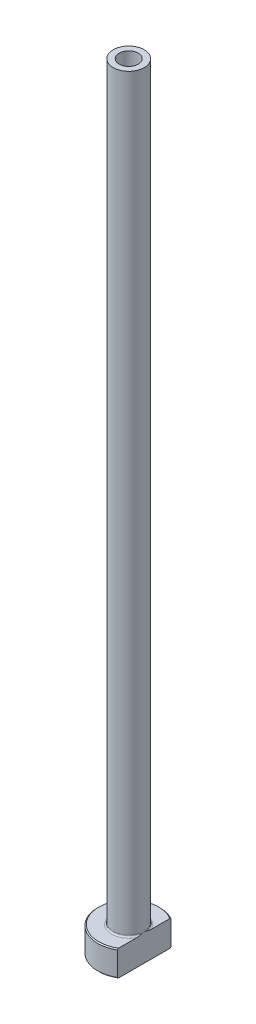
ISO-10303-21;
HEADER;
FILE_DESCRIPTION(('STEP AP214'),'2;1');
FILE_NAME('part.step','',(''),(''),'','','');
FILE_SCHEMA(('AUTOMOTIVE_DESIGN { 1 0 10303 214 1 1 1 1 }'));
ENDSEC;
DATA;
#1=APPLICATION_CONTEXT('core data for automotive mechanical design processes');
#2=APPLICATION_PROTOCOL_DEFINITION('international standard','automotive_design',2000,#1);
#3=PRODUCT_CONTEXT('',#1,'mechanical');
#4=PRODUCT('Part','Part','',(#3));
#5=PRODUCT_RELATED_PRODUCT_CATEGORY('part','',(#4));
#6=PRODUCT_DEFINITION_FORMATION('','',#4);
#7=PRODUCT_DEFINITION_CONTEXT('part definition',#1,'design');
#8=PRODUCT_DEFINITION('design','',#6,#7);
#9=PRODUCT_DEFINITION_SHAPE('','',#8);
#10=(LENGTH_UNIT() NAMED_UNIT(*) SI_UNIT(.MILLI.,.METRE.));
#11=(NAMED_UNIT(*) PLANE_ANGLE_UNIT() SI_UNIT($,.RADIAN.));
#12=(NAMED_UNIT(*) SI_UNIT($,.STERADIAN.) SOLID_ANGLE_UNIT());
#13=UNCERTAINTY_MEASURE_WITH_UNIT(LENGTH_MEASURE(1.E-05),#10,'distance_accuracy_value','');
#14=(GEOMETRIC_REPRESENTATION_CONTEXT(3) GLOBAL_UNCERTAINTY_ASSIGNED_CONTEXT((#13)) GLOBAL_UNIT_ASSIGNED_CONTEXT((#10,
#11,#12)) REPRESENTATION_CONTEXT('',''));
#15=CARTESIAN_POINT('',(0.,0.,0.));
#16=DIRECTION('',(0.,0.,1.));
#17=DIRECTION('',(1.,0.,0.));
#18=AXIS2_PLACEMENT_3D('',#15,#16,#17);
#19=CARTESIAN_POINT('',(0.,92.1876809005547,0.));
#20=DIRECTION('',(0.,1.,0.));
#21=DIRECTION('',(0.,0.,1.));
#22=AXIS2_PLACEMENT_3D('',#19,#20,#21);
#23=CYLINDRICAL_SURFACE('',#22,1.85);
#24=CARTESIAN_POINT('',(0.,150.,0.));
#25=DIRECTION('',(0.,1.,0.));
#26=DIRECTION('',(0.,0.,1.));
#27=AXIS2_PLACEMENT_3D('',#24,#25,#26);
#28=CIRCLE('',#27,1.85);
#29=CARTESIAN_POINT('',(0.,150.,1.85));
#30=VERTEX_POINT('',#29);
#31=EDGE_CURVE('E167',#30,#30,#28,.T.);
#32=ORIENTED_EDGE('',*,*,#31,.T.);
#33=EDGE_LOOP('',(#32));
#34=FACE_BOUND('',#33,.T.);
#35=CARTESIAN_POINT('',(0.,105.,0.));
#36=DIRECTION('',(0.,1.,0.));
#37=DIRECTION('',(0.,0.,1.));
#38=AXIS2_PLACEMENT_3D('',#35,#36,#37);
#39=CIRCLE('',#38,1.85);
#40=CARTESIAN_POINT('',(0.,105.,1.85));
#41=VERTEX_POINT('',#40);
#42=EDGE_CURVE('E170',#41,#41,#39,.T.);
#43=ORIENTED_EDGE('',*,*,#42,.F.);
#44=EDGE_LOOP('',(#43));
#45=FACE_BOUND('',#44,.T.);
#46=ADVANCED_FACE('F32',(#34,#45),#23,.F.);
#47=CARTESIAN_POINT('',(-1.85,150.,0.));
#48=DIRECTION('',(0.,1.,0.));
#49=DIRECTION('',(0.,0.,1.));
#50=AXIS2_PLACEMENT_3D('',#47,#48,#49);
#51=PLANE('',#50);
#52=CARTESIAN_POINT('',(0.,150.,0.));
#53=DIRECTION('',(0.,1.,0.));
#54=DIRECTION('',(0.,0.,1.));
#55=AXIS2_PLACEMENT_3D('',#52,#53,#54);
#56=CIRCLE('',#55,3.00000000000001);
#57=CARTESIAN_POINT('',(0.,150.,3.00000000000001));
#58=VERTEX_POINT('',#57);
#59=EDGE_CURVE('E174',#58,#58,#56,.T.);
#60=ORIENTED_EDGE('',*,*,#59,.T.);
#61=EDGE_LOOP('',(#60));
#62=FACE_BOUND('',#61,.T.);
#63=ORIENTED_EDGE('',*,*,#31,.F.);
#64=EDGE_LOOP('',(#63));
#65=FACE_BOUND('',#64,.T.);
#66=ADVANCED_FACE('F157',(#62,#65),#51,.T.);
#67=CARTESIAN_POINT('',(0.,92.1876809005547,0.));
#68=DIRECTION('',(0.,1.,0.));
#69=DIRECTION('',(0.,0.,1.));
#70=AXIS2_PLACEMENT_3D('',#67,#68,#69);
#71=CYLINDRICAL_SURFACE('',#70,3.);
#72=CARTESIAN_POINT('',(0.,5.3,0.));
#73=DIRECTION('',(0.,1.,0.));
#74=DIRECTION('',(0.,0.,1.));
#75=AXIS2_PLACEMENT_3D('',#72,#73,#74);
#76=CIRCLE('',#75,3.);
#77=CARTESIAN_POINT('',(3.,5.3,0.));
#78=VERTEX_POINT('',#77);
#79=EDGE_CURVE('E180',#78,#78,#76,.T.);
#80=ORIENTED_EDGE('',*,*,#79,.T.);
#81=EDGE_LOOP('',(#80));
#82=FACE_BOUND('',#81,.T.);
#83=ORIENTED_EDGE('',*,*,#59,.F.);
#84=EDGE_LOOP('',(#83));
#85=FACE_BOUND('',#84,.T.);
#86=ADVANCED_FACE('F162',(#82,#85),#71,.T.);
#87=CARTESIAN_POINT('',(-2.99999999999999,5.,0.));
#88=DIRECTION('',(0.,1.,0.));
#89=DIRECTION('',(0.,0.,1.));
#90=AXIS2_PLACEMENT_3D('',#87,#88,#89);
#91=PLANE('',#90);
#92=DIRECTION('',(0.,0.,1.));
#93=VECTOR('',#92,1.);
#94=CARTESIAN_POINT('',(3.,5.,0.));
#95=LINE('',#94,#93);
#96=CARTESIAN_POINT('',(3.,5.,-4.96386945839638));
#97=VERTEX_POINT('',#96);
#98=CARTESIAN_POINT('',(3.,5.,-1.37477270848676));
#99=VERTEX_POINT('',#98);
#100=EDGE_CURVE('E54',#97,#99,#95,.T.);
#101=ORIENTED_EDGE('',*,*,#100,.F.);
#102=CARTESIAN_POINT('',(0.,5.,0.));
#103=DIRECTION('',(0.,1.,0.));
#104=DIRECTION('',(0.,0.,1.));
#105=AXIS2_PLACEMENT_3D('',#102,#103,#104);
#106=CIRCLE('',#105,5.80000000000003);
#107=CARTESIAN_POINT('',(2.99999999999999,5.,4.96386945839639));
#108=VERTEX_POINT('',#107);
#109=EDGE_CURVE('E186',#97,#108,#106,.T.);
#110=ORIENTED_EDGE('',*,*,#109,.T.);
#111=CARTESIAN_POINT('',(3.,5.,1.37477270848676));
#112=VERTEX_POINT('',#111);
#113=EDGE_CURVE('E134',#112,#108,#95,.T.);
#114=ORIENTED_EDGE('',*,*,#113,.F.);
#115=CARTESIAN_POINT('',(0.,5.,0.));
#116=DIRECTION('',(0.,1.,0.));
#117=DIRECTION('',(0.,0.,1.));
#118=AXIS2_PLACEMENT_3D('',#115,#116,#117);
#119=CIRCLE('',#118,3.3);
#120=EDGE_CURVE('E183',#112,#99,#119,.F.);
#121=ORIENTED_EDGE('',*,*,#120,.T.);
#122=EDGE_LOOP('',(#101,#110,#114,#121));
#123=FACE_BOUND('',#122,.T.);
#124=ADVANCED_FACE('F197',(#123),#91,.T.);
#125=CARTESIAN_POINT('',(0.,92.1876809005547,0.));
#126=DIRECTION('',(0.,1.,0.));
#127=DIRECTION('',(0.,0.,1.));
#128=AXIS2_PLACEMENT_3D('',#125,#126,#127);
#129=CYLINDRICAL_SURFACE('',#128,5.99999999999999);
#130=DIRECTION('',(0.,-1.,0.));
#131=VECTOR('',#130,1.);
#132=CARTESIAN_POINT('',(2.99999999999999,150.,5.19615242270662));
#133=LINE('',#132,#131);
#134=CARTESIAN_POINT('',(2.99999999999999,4.80000000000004,5.19615242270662));
#135=VERTEX_POINT('',#134);
#136=CARTESIAN_POINT('',(2.99999999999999,0.200000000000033,5.19615242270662));
#137=VERTEX_POINT('',#136);
#138=EDGE_CURVE('E82',#135,#137,#133,.T.);
#139=ORIENTED_EDGE('',*,*,#138,.F.);
#140=CARTESIAN_POINT('',(0.,4.80000000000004,0.));
#141=DIRECTION('',(0.,1.,0.));
#142=DIRECTION('',(0.,0.,1.));
#143=AXIS2_PLACEMENT_3D('',#140,#141,#142);
#144=CIRCLE('',#143,5.99999999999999);
#145=CARTESIAN_POINT('',(3.,4.80000000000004,-5.19615242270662));
#146=VERTEX_POINT('',#145);
#147=EDGE_CURVE('E95',#135,#146,#144,.F.);
#148=ORIENTED_EDGE('',*,*,#147,.T.);
#149=DIRECTION('',(0.,-1.,0.));
#150=VECTOR('',#149,1.);
#151=CARTESIAN_POINT('',(3.,150.,-5.19615242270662));
#152=LINE('',#151,#150);
#153=CARTESIAN_POINT('',(3.,0.200000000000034,-5.19615242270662));
#154=VERTEX_POINT('',#153);
#155=EDGE_CURVE('E192',#146,#154,#152,.T.);
#156=ORIENTED_EDGE('',*,*,#155,.T.);
#157=CARTESIAN_POINT('',(0.,0.200000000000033,0.));
#158=DIRECTION('',(0.,-1.,0.));
#159=DIRECTION('',(0.,0.,-1.));
#160=AXIS2_PLACEMENT_3D('',#157,#158,#159);
#161=CIRCLE('',#160,5.99999999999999);
#162=EDGE_CURVE('E98',#154,#137,#161,.F.);
#163=ORIENTED_EDGE('',*,*,#162,.T.);
#164=EDGE_LOOP('',(#139,#148,#156,#163));
#165=FACE_BOUND('',#164,.T.);
#166=ADVANCED_FACE('F190',(#165),#129,.T.);
#167=CARTESIAN_POINT('',(-5.99999999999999,0.,0.));
#168=DIRECTION('',(0.,-1.,0.));
#169=DIRECTION('',(0.,0.,-1.));
#170=AXIS2_PLACEMENT_3D('',#167,#168,#169);
#171=PLANE('',#170);
#172=CARTESIAN_POINT('',(0.,0.,0.));
#173=DIRECTION('',(0.,-1.,0.));
#174=DIRECTION('',(0.,0.,-1.));
#175=AXIS2_PLACEMENT_3D('',#172,#173,#174);
#176=CIRCLE('',#175,2.59999999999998);
#177=CARTESIAN_POINT('',(0.,0.,-2.59999999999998));
#178=VERTEX_POINT('',#177);
#179=EDGE_CURVE('E40',#178,#178,#176,.F.);
#180=ORIENTED_EDGE('',*,*,#179,.T.);
#181=EDGE_LOOP('',(#180));
#182=FACE_BOUND('',#181,.T.);
#183=DIRECTION('',(0.,0.,-1.));
#184=VECTOR('',#183,1.);
#185=CARTESIAN_POINT('',(2.99999999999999,0.,5.19615242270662));
#186=LINE('',#185,#184);
#187=CARTESIAN_POINT('',(2.99999999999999,0.,4.9638694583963));
#188=VERTEX_POINT('',#187);
#189=CARTESIAN_POINT('',(3.,0.,-4.9638694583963));
#190=VERTEX_POINT('',#189);
#191=EDGE_CURVE('E47',#188,#190,#186,.T.);
#192=ORIENTED_EDGE('',*,*,#191,.F.);
#193=CARTESIAN_POINT('',(0.,0.,0.));
#194=DIRECTION('',(0.,-1.,0.));
#195=DIRECTION('',(0.,0.,-1.));
#196=AXIS2_PLACEMENT_3D('',#193,#194,#195);
#197=CIRCLE('',#196,5.79999999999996);
#198=EDGE_CURVE('E92',#188,#190,#197,.T.);
#199=ORIENTED_EDGE('',*,*,#198,.T.);
#200=EDGE_LOOP('',(#192,#199));
#201=FACE_BOUND('',#200,.T.);
#202=ADVANCED_FACE('F91',(#182,#201),#171,.T.);
#203=CARTESIAN_POINT('',(0.,92.1876809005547,0.));
#204=DIRECTION('',(0.,1.,0.));
#205=DIRECTION('',(0.,0.,1.));
#206=AXIS2_PLACEMENT_3D('',#203,#204,#205);
#207=CYLINDRICAL_SURFACE('',#206,2.1);
#208=CARTESIAN_POINT('',(0.,0.499999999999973,0.));
#209=DIRECTION('',(0.,-1.,0.));
#210=DIRECTION('',(0.,0.,-1.));
#211=AXIS2_PLACEMENT_3D('',#208,#209,#210);
#212=CIRCLE('',#211,2.1);
#213=CARTESIAN_POINT('',(0.,0.499999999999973,-2.1));
#214=VERTEX_POINT('',#213);
#215=EDGE_CURVE('E11',#214,#214,#212,.T.);
#216=ORIENTED_EDGE('',*,*,#215,.T.);
#217=EDGE_LOOP('',(#216));
#218=FACE_BOUND('',#217,.T.);
#219=CARTESIAN_POINT('',(0.,93.,0.));
#220=DIRECTION('',(0.,1.,0.));
#221=DIRECTION('',(0.,0.,1.));
#222=AXIS2_PLACEMENT_3D('',#219,#220,#221);
#223=CIRCLE('',#222,2.1);
#224=CARTESIAN_POINT('',(0.,93.,2.1));
#225=VERTEX_POINT('',#224);
#226=EDGE_CURVE('E172',#225,#225,#223,.T.);
#227=ORIENTED_EDGE('',*,*,#226,.T.);
#228=EDGE_LOOP('',(#227));
#229=FACE_BOUND('',#228,.T.);
#230=ADVANCED_FACE('F215',(#218,#229),#207,.F.);
#231=CARTESIAN_POINT('',(0.,93.,0.));
#232=DIRECTION('',(0.,-1.,0.));
#233=DIRECTION('',(0.,0.,-1.));
#234=AXIS2_PLACEMENT_3D('',#231,#232,#233);
#235=CONICAL_SURFACE('',#234,2.1,0.0208303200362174);
#236=ORIENTED_EDGE('',*,*,#42,.T.);
#237=EDGE_LOOP('',(#236));
#238=FACE_BOUND('',#237,.T.);
#239=ORIENTED_EDGE('',*,*,#226,.F.);
#240=EDGE_LOOP('',(#239));
#241=FACE_BOUND('',#240,.T.);
#242=ADVANCED_FACE('F111',(#238,#241),#235,.F.);
#243=CARTESIAN_POINT('',(0.,5.3,0.));
#244=DIRECTION('',(0.,1.,0.));
#245=DIRECTION('',(0.,0.,1.));
#246=AXIS2_PLACEMENT_3D('',#243,#244,#245);
#247=TOROIDAL_SURFACE('',#246,3.3,0.3);
#248=ORIENTED_EDGE('',*,*,#120,.F.);
#249=CARTESIAN_POINT('',(3.,5.3,0.));
#250=CARTESIAN_POINT('',(3.,5.30000062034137,-1.12611401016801E-10));
#251=CARTESIAN_POINT('',(3.,5.30000124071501,1.79706807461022E-07));
#252=CARTESIAN_POINT('',(3.,5.30000241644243,7.12597549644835E-07));
#253=CARTESIAN_POINT('',(3.,5.30000296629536,1.07470908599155E-06));
#254=CARTESIAN_POINT('',(3.,5.30000408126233,1.93940823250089E-06));
#255=CARTESIAN_POINT('',(3.,5.30000463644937,2.45488613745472E-06));
#256=CARTESIAN_POINT('',(3.,5.30000565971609,3.54465546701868E-06));
#257=CARTESIAN_POINT('',(3.,5.30000612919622,4.117706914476E-06));
#258=CARTESIAN_POINT('',(3.,5.30000778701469,6.25396475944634E-06));
#259=CARTESIAN_POINT('',(3.,5.30000888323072,7.89070882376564E-06));
#260=CARTESIAN_POINT('',(3.,5.30001076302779,1.11998056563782E-05));
#261=CARTESIAN_POINT('',(3.,5.30001156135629,1.28642115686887E-05));
#262=CARTESIAN_POINT('',(3.,5.30001474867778,1.96537177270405E-05));
#263=CARTESIAN_POINT('',(3.,5.30001702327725,2.48380246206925E-05));
#264=CARTESIAN_POINT('',(3.,5.30002052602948,3.48178491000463E-05));
#265=CARTESIAN_POINT('',(3.,5.30002184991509,3.95800633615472E-05));
#266=CARTESIAN_POINT('',(2.99999999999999,5.30003122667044,7.41814390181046E-05));
#267=CARTESIAN_POINT('',(2.99999999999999,5.30003808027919,0.000104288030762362));
#268=CARTESIAN_POINT('',(3.,5.30006804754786,0.000222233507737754));
#269=CARTESIAN_POINT('',(3.,5.3000968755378,0.000308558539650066));
#270=CARTESIAN_POINT('',(2.99999999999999,5.30020809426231,0.000648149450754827));
#271=CARTESIAN_POINT('',(2.99999999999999,5.30028657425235,0.000902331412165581));
#272=CARTESIAN_POINT('',(3.,5.3005987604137,0.001904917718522));
#273=CARTESIAN_POINT('',(3.,5.30083723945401,0.00265218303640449));
#274=CARTESIAN_POINT('',(2.99999999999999,5.3018219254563,0.00574694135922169));
#275=CARTESIAN_POINT('',(2.99999999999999,5.30256224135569,0.00809584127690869));
#276=CARTESIAN_POINT('',(3.00000000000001,5.31160267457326,0.0367678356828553));
#277=CARTESIAN_POINT('',(3.,5.3199381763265,0.0630827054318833));
#278=CARTESIAN_POINT('',(2.99999999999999,5.33621504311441,0.114704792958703));
#279=CARTESIAN_POINT('',(2.99999999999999,5.34415908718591,0.140011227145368));
#280=CARTESIAN_POINT('',(3.,5.36094382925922,0.193774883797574));
#281=CARTESIAN_POINT('',(3.,5.36977415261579,0.222235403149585));
#282=CARTESIAN_POINT('',(2.99999999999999,5.38736474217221,0.279512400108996));
#283=CARTESIAN_POINT('',(2.99999999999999,5.39612323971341,0.308329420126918));
#284=CARTESIAN_POINT('',(2.99999999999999,5.41726575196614,0.378880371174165));
#285=CARTESIAN_POINT('',(2.99999999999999,5.4295272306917,0.420651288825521));
#286=CARTESIAN_POINT('',(2.99999999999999,5.45309597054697,0.503357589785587));
#287=CARTESIAN_POINT('',(2.99999999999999,5.46441924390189,0.544288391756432));
#288=CARTESIAN_POINT('',(2.99999999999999,5.48778169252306,0.632156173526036));
#289=CARTESIAN_POINT('',(2.99999999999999,5.49969678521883,0.679126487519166));
#290=CARTESIAN_POINT('',(2.99999999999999,5.52221484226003,0.773740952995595));
#291=CARTESIAN_POINT('',(2.99999999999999,5.53280772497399,0.821387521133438));
#292=CARTESIAN_POINT('',(2.99999999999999,5.55291503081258,0.920589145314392));
#293=CARTESIAN_POINT('',(2.99999999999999,5.56229188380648,0.972172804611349));
#294=CARTESIAN_POINT('',(2.99999999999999,5.57838694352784,1.07574836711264));
#295=CARTESIAN_POINT('',(2.99999999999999,5.58510535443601,1.12774023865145));
#296=CARTESIAN_POINT('',(2.99999999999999,5.59681427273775,1.24924411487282));
#297=CARTESIAN_POINT('',(2.99999999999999,5.60051317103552,1.31890364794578));
#298=CARTESIAN_POINT('',(2.99999999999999,5.59966579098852,1.42270835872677));
#299=CARTESIAN_POINT('',(2.99999999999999,5.59835823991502,1.4568809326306));
#300=CARTESIAN_POINT('',(2.99999999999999,5.59322745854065,1.52502533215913));
#301=CARTESIAN_POINT('',(2.99999999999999,5.58940645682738,1.55899730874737));
#302=CARTESIAN_POINT('',(2.99999999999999,5.57976146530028,1.61947815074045));
#303=CARTESIAN_POINT('',(2.99999999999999,5.57451506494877,1.64607760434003));
#304=CARTESIAN_POINT('',(2.99999999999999,5.56161153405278,1.69883648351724));
#305=CARTESIAN_POINT('',(2.99999999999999,5.55394338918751,1.7249933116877));
#306=CARTESIAN_POINT('',(2.99999999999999,5.53555176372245,1.77650913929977));
#307=CARTESIAN_POINT('',(2.99999999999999,5.52480031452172,1.801858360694));
#308=CARTESIAN_POINT('',(2.99999999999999,5.49948027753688,1.85054545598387));
#309=CARTESIAN_POINT('',(2.99999999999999,5.48493141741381,1.87389291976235));
#310=CARTESIAN_POINT('',(2.99999999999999,5.45992470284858,1.90552135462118));
#311=CARTESIAN_POINT('',(2.99999999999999,5.45133318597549,1.91527363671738));
#312=CARTESIAN_POINT('',(2.99999999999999,5.43294163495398,1.93360072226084));
#313=CARTESIAN_POINT('',(2.99999999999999,5.42314083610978,1.94217477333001));
#314=CARTESIAN_POINT('',(2.99999999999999,5.40215892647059,1.95778354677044));
#315=CARTESIAN_POINT('',(2.99999999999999,5.39096156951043,1.96479687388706));
#316=CARTESIAN_POINT('',(2.99999999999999,5.36742144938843,1.97652218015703));
#317=CARTESIAN_POINT('',(2.99999999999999,5.35508207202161,1.98124071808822));
#318=CARTESIAN_POINT('',(2.99999999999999,5.33320117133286,1.9869018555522));
#319=CARTESIAN_POINT('',(2.99999999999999,5.323835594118,1.9885295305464));
#320=CARTESIAN_POINT('',(2.99999999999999,5.30496375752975,1.99016898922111));
#321=CARTESIAN_POINT('',(2.99999999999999,5.29545756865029,1.99018155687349));
#322=CARTESIAN_POINT('',(2.99999999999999,5.27659318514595,1.98858978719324));
#323=CARTESIAN_POINT('',(2.99999999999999,5.26723486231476,1.98698693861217));
#324=CARTESIAN_POINT('',(2.99999999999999,5.24889957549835,1.98229727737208));
#325=CARTESIAN_POINT('',(2.99999999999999,5.23992286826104,1.97920948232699));
#326=CARTESIAN_POINT('',(2.99999999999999,5.21981293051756,1.97059641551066));
#327=CARTESIAN_POINT('',(2.99999999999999,5.20887713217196,1.96461176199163));
#328=CARTESIAN_POINT('',(2.99999999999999,5.18811536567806,1.95095727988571));
#329=CARTESIAN_POINT('',(2.99999999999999,5.17829177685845,1.9432839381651));
#330=CARTESIAN_POINT('',(2.99999999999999,5.15512177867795,1.92254223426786));
#331=CARTESIAN_POINT('',(2.99999999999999,5.14247568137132,1.90869680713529));
#332=CARTESIAN_POINT('',(2.99999999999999,5.11944595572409,1.87927587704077));
#333=CARTESIAN_POINT('',(2.99999999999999,5.10906527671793,1.86369815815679));
#334=CARTESIAN_POINT('',(2.99999999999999,5.08309609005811,1.81927355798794));
#335=CARTESIAN_POINT('',(2.99999999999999,5.06948546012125,1.7892808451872));
#336=CARTESIAN_POINT('',(2.99999999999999,5.04658664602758,1.72751962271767));
#337=CARTESIAN_POINT('',(2.99999999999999,5.0373358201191,1.69573828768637));
#338=CARTESIAN_POINT('',(2.99999999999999,5.02214318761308,1.63079918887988));
#339=CARTESIAN_POINT('',(2.99999999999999,5.01626537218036,1.5976268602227));
#340=CARTESIAN_POINT('',(2.99999999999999,5.00734002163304,1.53086029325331));
#341=CARTESIAN_POINT('',(2.99999999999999,5.00429797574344,1.49726536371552));
#342=CARTESIAN_POINT('',(2.99999999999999,5.00059037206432,1.43100872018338));
#343=CARTESIAN_POINT('',(2.99999999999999,4.99985343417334,1.398350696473));
#344=CARTESIAN_POINT('',(2.99999999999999,5.00019322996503,1.33318312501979));
#345=CARTESIAN_POINT('',(2.99999999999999,5.00126261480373,1.30067351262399));
#346=CARTESIAN_POINT('',(2.99999999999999,5.00569854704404,1.22190465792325));
#347=CARTESIAN_POINT('',(2.99999999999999,5.00984986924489,1.17569031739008));
#348=CARTESIAN_POINT('',(2.99999999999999,5.02060876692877,1.08357061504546));
#349=CARTESIAN_POINT('',(2.99999999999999,5.027215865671,1.03766519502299));
#350=CARTESIAN_POINT('',(2.99999999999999,5.04258096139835,0.94513016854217));
#351=CARTESIAN_POINT('',(2.99999999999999,5.05138514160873,0.898508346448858));
#352=CARTESIAN_POINT('',(2.99999999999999,5.0706686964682,0.80549666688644));
#353=CARTESIAN_POINT('',(2.99999999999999,5.08115218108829,0.759107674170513));
#354=CARTESIAN_POINT('',(2.99999999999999,5.10738921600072,0.650207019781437));
#355=CARTESIAN_POINT('',(2.99999999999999,5.12369110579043,0.587828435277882));
#356=CARTESIAN_POINT('',(2.99999999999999,5.15777680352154,0.464212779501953));
#357=CARTESIAN_POINT('',(2.99999999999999,5.17554263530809,0.402970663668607));
#358=CARTESIAN_POINT('',(3.,5.21006724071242,0.287596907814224));
#359=CARTESIAN_POINT('',(3.,5.22671796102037,0.233432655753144));
#360=CARTESIAN_POINT('',(2.99999999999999,5.25241226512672,0.150940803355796));
#361=CARTESIAN_POINT('',(2.99999999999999,5.26131063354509,0.122567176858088));
#362=CARTESIAN_POINT('',(3.,5.27905176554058,0.0662804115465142));
#363=CARTESIAN_POINT('',(3.00000000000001,5.28789327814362,0.0383669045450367));
#364=CARTESIAN_POINT('',(2.99999999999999,5.29743877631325,0.00809257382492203));
#365=CARTESIAN_POINT('',(2.99999999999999,5.29818012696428,0.00574041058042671));
#366=CARTESIAN_POINT('',(3.,5.29916506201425,0.00264489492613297));
#367=CARTESIAN_POINT('',(3.,5.29940274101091,0.00190013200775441));
#368=CARTESIAN_POINT('',(2.99999999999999,5.29971394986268,0.000900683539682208));
#369=CARTESIAN_POINT('',(2.99999999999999,5.29979223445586,0.000647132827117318));
#370=CARTESIAN_POINT('',(3.,5.29990321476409,0.000308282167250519));
#371=CARTESIAN_POINT('',(3.,5.29993200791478,0.000222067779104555));
#372=CARTESIAN_POINT('',(2.99999999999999,5.29996194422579,0.000104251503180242));
#373=CARTESIAN_POINT('',(2.99999999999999,5.29996879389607,7.41614226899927E-05));
#374=CARTESIAN_POINT('',(3.,5.29997816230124,3.95766696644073E-05));
#375=CARTESIAN_POINT('',(3.,5.29997948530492,3.48154655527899E-05));
#376=CARTESIAN_POINT('',(3.,5.29998298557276,2.48376270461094E-05));
#377=CARTESIAN_POINT('',(3.,5.29998525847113,1.9654244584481E-05));
#378=CARTESIAN_POINT('',(3.,5.29998844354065,1.28656650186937E-05));
#379=CARTESIAN_POINT('',(3.,5.29998924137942,1.12013344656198E-05));
#380=CARTESIAN_POINT('',(3.,5.29999112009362,7.89229985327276E-06));
#381=CARTESIAN_POINT('',(3.,5.29999221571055,6.25553499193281E-06));
#382=CARTESIAN_POINT('',(3.,5.29999387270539,4.11914345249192E-06));
#383=CARTESIAN_POINT('',(3.,5.29999434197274,3.5460307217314E-06));
#384=CARTESIAN_POINT('',(3.,5.2999953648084,2.456100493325E-06));
#385=CARTESIAN_POINT('',(3.,5.299995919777,1.94052212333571E-06));
#386=CARTESIAN_POINT('',(3.,5.29999703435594,1.07558312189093E-06));
#387=CARTESIAN_POINT('',(3.,5.29999758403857,7.13339355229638E-07));
#388=CARTESIAN_POINT('',(3.,5.29999875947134,1.80121902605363E-07));
#389=CARTESIAN_POINT('',(3.,5.29999937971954,1.12600845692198E-10));
#390=CARTESIAN_POINT('',(3.,5.3,0.));
#391=B_SPLINE_CURVE_WITH_KNOTS('',3,(#249,#250,#251,#252,#253,#254,#255,#256,#257,#258,#259,
#260,#261,#262,#263,#264,#265,#266,#267,#268,#269,#270,#271,#272,#273,#274,#275,#276,#277,#278,
#279,#280,#281,#282,#283,#284,#285,#286,#287,#288,#289,#290,#291,#292,#293,#294,#295,#296,#297,
#298,#299,#300,#301,#302,#303,#304,#305,#306,#307,#308,#309,#310,#311,#312,#313,#314,#315,#316,
#317,#318,#319,#320,#321,#322,#323,#324,#325,#326,#327,#328,#329,#330,#331,#332,#333,#334,#335,
#336,#337,#338,#339,#340,#341,#342,#343,#344,#345,#346,#347,#348,#349,#350,#351,#352,#353,#354,
#355,#356,#357,#358,#359,#360,#361,#362,#363,#364,#365,#366,#367,#368,#369,#370,#371,#372,#373,
#374,#375,#376,#377,#378,#379,#380,#381,#382,#383,#384,#385,#386,#387,#388,#389,#390),
.UNSPECIFIED.,.T.,.F.,(4,2,2,2,2,2,2,2,2,2,2,2,2,2,2,2,2,2,2,2,2,2,2,2,2,2,2,2,2,2,2,2,2,2,2,2,
2,2,2,2,2,2,2,2,2,2,2,2,2,2,2,2,2,2,2,2,2,2,2,2,2,2,2,2,2,2,2,2,2,2,4),(0.,1.86513890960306E-06,
3.83353294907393E-06,6.09513300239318E-06,8.31560621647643E-06,1.42000707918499E-05,
1.97335509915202E-05,3.66769873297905E-05,5.14858328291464E-05,0.000144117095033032,
0.000416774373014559,0.00121521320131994,0.00356794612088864,0.0109568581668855,
0.0937636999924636,0.173336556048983,0.262732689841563,0.35308814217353,0.483684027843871,
0.611082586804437,0.756439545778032,0.902844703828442,1.06007042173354,1.21728406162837,
1.42611662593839,1.52864191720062,1.63107642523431,1.71232857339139,1.79395571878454,
1.87634808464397,1.95832065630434,1.99722769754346,2.03615946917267,2.07559591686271,
2.11491897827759,2.14330913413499,2.17168550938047,2.20003575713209,2.22840478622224,
2.26559554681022,2.30286442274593,2.35880214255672,2.41481225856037,2.51307007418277,
2.61215518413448,2.71306273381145,2.81416520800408,2.91210427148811,3.00964583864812,
3.14875779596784,3.28784276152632,3.43014232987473,3.57279564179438,3.76617940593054,
3.95746724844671,4.12746077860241,4.21667041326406,4.30450746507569,4.311906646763,
4.31425150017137,4.31504795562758,4.31532026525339,4.31541284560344,4.31542765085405,
4.31544458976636,4.31545012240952,4.31545600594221,4.31545822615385,4.31546048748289,
4.31546245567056,4.31546432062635),.UNSPECIFIED.);
#392=EDGE_CURVE('E126',#112,#78,#391,.T.);
#393=ORIENTED_EDGE('',*,*,#392,.T.);
#394=ORIENTED_EDGE('',*,*,#79,.F.);
#395=CARTESIAN_POINT('',(3.,5.3,0.));
#396=CARTESIAN_POINT('',(3.,5.29999937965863,1.1261168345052E-10));
#397=CARTESIAN_POINT('',(3.,5.29999875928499,-1.79706807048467E-07));
#398=CARTESIAN_POINT('',(3.,5.29999758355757,-7.12597549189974E-07));
#399=CARTESIAN_POINT('',(3.,5.29999703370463,-1.07470908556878E-06));
#400=CARTESIAN_POINT('',(3.,5.29999591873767,-1.93940823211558E-06));
#401=CARTESIAN_POINT('',(3.,5.29999536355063,-2.45488613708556E-06));
#402=CARTESIAN_POINT('',(3.,5.29999434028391,-3.54465546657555E-06));
#403=CARTESIAN_POINT('',(3.,5.29999387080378,-4.11770691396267E-06));
#404=CARTESIAN_POINT('',(3.,5.29999221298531,-6.25396475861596E-06));
#405=CARTESIAN_POINT('',(3.,5.29999111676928,-7.89070882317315E-06));
#406=CARTESIAN_POINT('',(3.,5.29998923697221,-1.11998056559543E-05));
#407=CARTESIAN_POINT('',(3.,5.29998843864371,-1.28642115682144E-05));
#408=CARTESIAN_POINT('',(3.,5.29998525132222,-1.96537177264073E-05));
#409=CARTESIAN_POINT('',(3.,5.29998297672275,-2.48380246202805E-05));
#410=CARTESIAN_POINT('',(3.,5.29997947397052,-3.48178490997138E-05));
#411=CARTESIAN_POINT('',(3.,5.29997815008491,-3.95800633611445E-05));
#412=CARTESIAN_POINT('',(2.99999999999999,5.29996877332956,-7.41814390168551E-05));
#413=CARTESIAN_POINT('',(2.99999999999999,5.2999619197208,-0.000104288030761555));
#414=CARTESIAN_POINT('',(3.,5.29993195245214,-0.000222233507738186));
#415=CARTESIAN_POINT('',(3.,5.2999031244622,-0.000308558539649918));
#416=CARTESIAN_POINT('',(2.99999999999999,5.29979190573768,-0.000648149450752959));
#417=CARTESIAN_POINT('',(2.99999999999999,5.29971342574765,-0.000902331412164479));
#418=CARTESIAN_POINT('',(3.,5.29940123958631,-0.00190491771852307));
#419=CARTESIAN_POINT('',(3.,5.29916276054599,-0.0026521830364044));
#420=CARTESIAN_POINT('',(2.99999999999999,5.29817807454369,-0.00574694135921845));
#421=CARTESIAN_POINT('',(2.99999999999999,5.2974377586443,-0.00809584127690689));
#422=CARTESIAN_POINT('',(3.00000000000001,5.28839732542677,-0.0367678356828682));
#423=CARTESIAN_POINT('',(3.,5.28006182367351,-0.063082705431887));
#424=CARTESIAN_POINT('',(2.99999999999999,5.26378495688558,-0.114704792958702));
#425=CARTESIAN_POINT('',(2.99999999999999,5.25584091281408,-0.140011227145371));
#426=CARTESIAN_POINT('',(3.,5.23905617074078,-0.19377488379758));
#427=CARTESIAN_POINT('',(3.,5.2302258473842,-0.22223540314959));
#428=CARTESIAN_POINT('',(2.99999999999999,5.21263525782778,-0.279512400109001));
#429=CARTESIAN_POINT('',(2.99999999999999,5.20387676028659,-0.308329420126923));
#430=CARTESIAN_POINT('',(2.99999999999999,5.18273424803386,-0.37888037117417));
#431=CARTESIAN_POINT('',(2.99999999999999,5.1704727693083,-0.420651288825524));
#432=CARTESIAN_POINT('',(2.99999999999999,5.14690402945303,-0.503357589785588));
#433=CARTESIAN_POINT('',(2.99999999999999,5.13558075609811,-0.544288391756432));
#434=CARTESIAN_POINT('',(2.99999999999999,5.11221830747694,-0.632156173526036));
#435=CARTESIAN_POINT('',(2.99999999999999,5.10030321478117,-0.679126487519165));
#436=CARTESIAN_POINT('',(2.99999999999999,5.07778515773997,-0.773740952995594));
#437=CARTESIAN_POINT('',(2.99999999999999,5.06719227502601,-0.821387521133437));
#438=CARTESIAN_POINT('',(2.99999999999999,5.04708496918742,-0.920589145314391));
#439=CARTESIAN_POINT('',(2.99999999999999,5.03770811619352,-0.972172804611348));
#440=CARTESIAN_POINT('',(2.99999999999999,5.02161305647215,-1.07574836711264));
#441=CARTESIAN_POINT('',(2.99999999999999,5.01489464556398,-1.12774023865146));
#442=CARTESIAN_POINT('',(2.99999999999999,5.00318572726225,-1.24924411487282));
#443=CARTESIAN_POINT('',(2.99999999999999,4.99948682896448,-1.31890364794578));
#444=CARTESIAN_POINT('',(2.99999999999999,5.00033420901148,-1.42270835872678));
#445=CARTESIAN_POINT('',(2.99999999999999,5.00164176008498,-1.4568809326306));
#446=CARTESIAN_POINT('',(2.99999999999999,5.00677254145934,-1.52502533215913));
#447=CARTESIAN_POINT('',(2.99999999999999,5.01059354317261,-1.55899730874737));
#448=CARTESIAN_POINT('',(2.99999999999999,5.02023853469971,-1.61947815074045));
#449=CARTESIAN_POINT('',(2.99999999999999,5.02548493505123,-1.64607760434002));
#450=CARTESIAN_POINT('',(2.99999999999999,5.03838846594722,-1.69883648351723));
#451=CARTESIAN_POINT('',(2.99999999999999,5.04605661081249,-1.7249933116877));
#452=CARTESIAN_POINT('',(2.99999999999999,5.06444823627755,-1.77650913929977));
#453=CARTESIAN_POINT('',(2.99999999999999,5.07519968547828,-1.80185836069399));
#454=CARTESIAN_POINT('',(2.99999999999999,5.10051972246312,-1.85054545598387));
#455=CARTESIAN_POINT('',(2.99999999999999,5.11506858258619,-1.87389291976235));
#456=CARTESIAN_POINT('',(2.99999999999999,5.14007529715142,-1.90552135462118));
#457=CARTESIAN_POINT('',(2.99999999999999,5.14866681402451,-1.91527363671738));
#458=CARTESIAN_POINT('',(2.99999999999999,5.16705836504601,-1.93360072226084));
#459=CARTESIAN_POINT('',(2.99999999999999,5.17685916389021,-1.94217477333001));
#460=CARTESIAN_POINT('',(2.99999999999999,5.19784107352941,-1.95778354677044));
#461=CARTESIAN_POINT('',(2.99999999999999,5.20903843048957,-1.96479687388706));
#462=CARTESIAN_POINT('',(2.99999999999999,5.23257855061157,-1.97652218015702));
#463=CARTESIAN_POINT('',(2.99999999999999,5.24491792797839,-1.98124071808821));
#464=CARTESIAN_POINT('',(2.99999999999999,5.26679882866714,-1.9869018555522));
#465=CARTESIAN_POINT('',(2.99999999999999,5.27616440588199,-1.9885295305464));
#466=CARTESIAN_POINT('',(2.99999999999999,5.29503624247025,-1.99016898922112));
#467=CARTESIAN_POINT('',(2.99999999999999,5.30454243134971,-1.99018155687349));
#468=CARTESIAN_POINT('',(2.99999999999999,5.32340681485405,-1.98858978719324));
#469=CARTESIAN_POINT('',(2.99999999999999,5.33276513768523,-1.98698693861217));
#470=CARTESIAN_POINT('',(2.99999999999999,5.35110042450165,-1.98229727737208));
#471=CARTESIAN_POINT('',(2.99999999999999,5.36007713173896,-1.97920948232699));
#472=CARTESIAN_POINT('',(2.99999999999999,5.38018706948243,-1.97059641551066));
#473=CARTESIAN_POINT('',(2.99999999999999,5.39112286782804,-1.96461176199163));
#474=CARTESIAN_POINT('',(2.99999999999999,5.41188463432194,-1.95095727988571));
#475=CARTESIAN_POINT('',(2.99999999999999,5.42170822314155,-1.94328393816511));
#476=CARTESIAN_POINT('',(2.99999999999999,5.44487822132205,-1.92254223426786));
#477=CARTESIAN_POINT('',(2.99999999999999,5.45752431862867,-1.90869680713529));
#478=CARTESIAN_POINT('',(2.99999999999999,5.48055404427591,-1.87927587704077));
#479=CARTESIAN_POINT('',(2.99999999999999,5.49093472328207,-1.86369815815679));
#480=CARTESIAN_POINT('',(2.99999999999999,5.51690390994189,-1.81927355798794));
#481=CARTESIAN_POINT('',(2.99999999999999,5.53051453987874,-1.7892808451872));
#482=CARTESIAN_POINT('',(2.99999999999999,5.55341335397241,-1.72751962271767));
#483=CARTESIAN_POINT('',(2.99999999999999,5.5626641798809,-1.69573828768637));
#484=CARTESIAN_POINT('',(2.99999999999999,5.57785681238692,-1.63079918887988));
#485=CARTESIAN_POINT('',(2.99999999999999,5.58373462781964,-1.5976268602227));
#486=CARTESIAN_POINT('',(2.99999999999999,5.59265997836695,-1.53086029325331));
#487=CARTESIAN_POINT('',(2.99999999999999,5.59570202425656,-1.49726536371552));
#488=CARTESIAN_POINT('',(2.99999999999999,5.59940962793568,-1.43100872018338));
#489=CARTESIAN_POINT('',(2.99999999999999,5.60014656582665,-1.39835069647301));
#490=CARTESIAN_POINT('',(2.99999999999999,5.59980677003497,-1.33318312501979));
#491=CARTESIAN_POINT('',(2.99999999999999,5.59873738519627,-1.300673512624));
#492=CARTESIAN_POINT('',(2.99999999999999,5.59430145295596,-1.22190465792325));
#493=CARTESIAN_POINT('',(2.99999999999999,5.59015013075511,-1.17569031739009));
#494=CARTESIAN_POINT('',(2.99999999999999,5.57939123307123,-1.08357061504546));
#495=CARTESIAN_POINT('',(2.99999999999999,5.57278413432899,-1.03766519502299));
#496=CARTESIAN_POINT('',(2.99999999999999,5.55741903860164,-0.945130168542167));
#497=CARTESIAN_POINT('',(2.99999999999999,5.54861485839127,-0.898508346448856));
#498=CARTESIAN_POINT('',(2.99999999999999,5.52933130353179,-0.805496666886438));
#499=CARTESIAN_POINT('',(2.99999999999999,5.51884781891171,-0.75910767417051));
#500=CARTESIAN_POINT('',(2.99999999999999,5.49261078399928,-0.650207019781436));
#501=CARTESIAN_POINT('',(2.99999999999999,5.47630889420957,-0.587828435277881));
#502=CARTESIAN_POINT('',(2.99999999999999,5.44222319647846,-0.464212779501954));
#503=CARTESIAN_POINT('',(2.99999999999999,5.42445736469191,-0.40297066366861));
#504=CARTESIAN_POINT('',(3.,5.38993275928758,-0.287596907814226));
#505=CARTESIAN_POINT('',(3.,5.37328203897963,-0.233432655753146));
#506=CARTESIAN_POINT('',(2.99999999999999,5.34758773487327,-0.150940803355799));
#507=CARTESIAN_POINT('',(2.99999999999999,5.3386893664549,-0.122567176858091));
#508=CARTESIAN_POINT('',(3.,5.32094823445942,-0.0662804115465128));
#509=CARTESIAN_POINT('',(3.00000000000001,5.31210672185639,-0.0383669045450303));
#510=CARTESIAN_POINT('',(2.99999999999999,5.30256122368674,-0.00809257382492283));
#511=CARTESIAN_POINT('',(2.99999999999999,5.30181987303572,-0.00574041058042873));
#512=CARTESIAN_POINT('',(3.,5.30083493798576,-0.00264489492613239));
#513=CARTESIAN_POINT('',(3.,5.30059725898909,-0.00190013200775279));
#514=CARTESIAN_POINT('',(2.99999999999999,5.30028605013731,-0.000900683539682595));
#515=CARTESIAN_POINT('',(2.99999999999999,5.30020776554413,-0.000647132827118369));
#516=CARTESIAN_POINT('',(3.,5.30009678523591,-0.000308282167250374));
#517=CARTESIAN_POINT('',(3.,5.30006799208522,-0.000222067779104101));
#518=CARTESIAN_POINT('',(2.99999999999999,5.30003805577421,-0.000104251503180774));
#519=CARTESIAN_POINT('',(2.99999999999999,5.30003120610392,-7.41614226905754E-05));
#520=CARTESIAN_POINT('',(3.,5.30002183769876,-3.95766696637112E-05));
#521=CARTESIAN_POINT('',(3.,5.30002051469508,-3.48154655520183E-05));
#522=CARTESIAN_POINT('',(3.,5.30001701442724,-2.48376270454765E-05));
#523=CARTESIAN_POINT('',(3.,5.30001474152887,-1.9654244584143E-05));
#524=CARTESIAN_POINT('',(3.,5.30001155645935,-1.28656650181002E-05));
#525=CARTESIAN_POINT('',(3.,5.30001075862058,-1.12013344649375E-05));
#526=CARTESIAN_POINT('',(3.,5.30000887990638,-7.89229985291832E-06));
#527=CARTESIAN_POINT('',(3.,5.30000778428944,-6.25553499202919E-06));
#528=CARTESIAN_POINT('',(3.,5.3000061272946,-4.11914345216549E-06));
#529=CARTESIAN_POINT('',(3.,5.30000565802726,-3.54603072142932E-06));
#530=CARTESIAN_POINT('',(3.,5.3000046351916,-2.45610049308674E-06));
#531=CARTESIAN_POINT('',(3.,5.300004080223,-1.94052212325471E-06));
#532=CARTESIAN_POINT('',(3.,5.30000296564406,-1.07558312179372E-06));
#533=CARTESIAN_POINT('',(3.,5.30000241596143,-7.13339354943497E-07));
#534=CARTESIAN_POINT('',(3.,5.30000124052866,-1.80121901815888E-07));
#535=CARTESIAN_POINT('',(3.,5.30000062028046,-1.12600126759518E-10));
#536=CARTESIAN_POINT('',(3.,5.3,0.));
#537=B_SPLINE_CURVE_WITH_KNOTS('',3,(#395,#396,#397,#398,#399,#400,#401,#402,#403,#404,#405,
#406,#407,#408,#409,#410,#411,#412,#413,#414,#415,#416,#417,#418,#419,#420,#421,#422,#423,#424,
#425,#426,#427,#428,#429,#430,#431,#432,#433,#434,#435,#436,#437,#438,#439,#440,#441,#442,#443,
#444,#445,#446,#447,#448,#449,#450,#451,#452,#453,#454,#455,#456,#457,#458,#459,#460,#461,#462,
#463,#464,#465,#466,#467,#468,#469,#470,#471,#472,#473,#474,#475,#476,#477,#478,#479,#480,#481,
#482,#483,#484,#485,#486,#487,#488,#489,#490,#491,#492,#493,#494,#495,#496,#497,#498,#499,#500,
#501,#502,#503,#504,#505,#506,#507,#508,#509,#510,#511,#512,#513,#514,#515,#516,#517,#518,#519,
#520,#521,#522,#523,#524,#525,#526,#527,#528,#529,#530,#531,#532,#533,#534,#535,#536),
.UNSPECIFIED.,.T.,.F.,(4,2,2,2,2,2,2,2,2,2,2,2,2,2,2,2,2,2,2,2,2,2,2,2,2,2,2,2,2,2,2,2,2,2,2,2,
2,2,2,2,2,2,2,2,2,2,2,2,2,2,2,2,2,2,2,2,2,2,2,2,2,2,2,2,2,2,2,2,2,2,4),(0.,1.86513890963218E-06,
3.83353294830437E-06,6.0951330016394E-06,8.31560621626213E-06,1.42000707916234E-05,
1.97335509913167E-05,3.66769873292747E-05,5.14858328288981E-05,0.000144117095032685,
0.000416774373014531,0.00121521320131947,0.00356794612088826,0.0109568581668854,
0.0937636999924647,0.173336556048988,0.262732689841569,0.353088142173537,0.483684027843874,
0.611082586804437,0.756439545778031,0.902844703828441,1.06007042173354,1.21728406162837,
1.42611662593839,1.52864191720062,1.63107642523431,1.71232857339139,1.79395571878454,
1.87634808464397,1.95832065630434,1.99722769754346,2.03615946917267,2.07559591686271,
2.11491897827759,2.14330913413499,2.17168550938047,2.20003575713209,2.22840478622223,
2.26559554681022,2.30286442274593,2.35880214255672,2.41481225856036,2.51307007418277,
2.61215518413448,2.71306273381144,2.81416520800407,2.91210427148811,3.00964583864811,
3.14875779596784,3.28784276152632,3.43014232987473,3.57279564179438,3.76617940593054,
3.95746724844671,4.12746077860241,4.21667041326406,4.30450746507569,4.31190664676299,
4.31425150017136,4.31504795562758,4.31532026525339,4.31541284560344,4.31542765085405,
4.31544458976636,4.31545012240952,4.3154560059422,4.31545822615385,4.31546048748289,
4.31546245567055,4.31546432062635),.UNSPECIFIED.);
#538=EDGE_CURVE('E135',#78,#99,#537,.T.);
#539=ORIENTED_EDGE('',*,*,#538,.T.);
#540=EDGE_LOOP('',(#248,#393,#394,#539));
#541=FACE_BOUND('',#540,.T.);
#542=ADVANCED_FACE('F141',(#541),#247,.F.);
#543=CARTESIAN_POINT('',(0.,5.,0.));
#544=DIRECTION('',(0.,-1.,0.));
#545=DIRECTION('',(0.,0.,-1.));
#546=AXIS2_PLACEMENT_3D('',#543,#544,#545);
#547=CONICAL_SURFACE('',#546,5.80000000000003,0.785398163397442);
#548=CARTESIAN_POINT('',(3.,-1.01993959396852,-11.432889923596));
#549=CARTESIAN_POINT('',(3.,-0.769424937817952,-11.1738796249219));
#550=CARTESIAN_POINT('',(3.,-0.519179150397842,-10.9146084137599));
#551=CARTESIAN_POINT('',(3.,-0.0193842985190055,-10.395389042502));
#552=CARTESIAN_POINT('',(3.,0.230164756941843,-10.1354408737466));
#553=CARTESIAN_POINT('',(3.,0.72852805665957,-9.61458602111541));
#554=CARTESIAN_POINT('',(3.,0.977341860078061,-9.3536789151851));
#555=CARTESIAN_POINT('',(3.,1.47386965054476,-8.8308227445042));
#556=CARTESIAN_POINT('',(3.,1.72158364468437,-8.56887368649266));
#557=CARTESIAN_POINT('',(3.,2.2106928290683,-8.04884148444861));
#558=CARTESIAN_POINT('',(3.,2.45211594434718,-7.79078462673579));
#559=CARTESIAN_POINT('',(3.,2.93315589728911,-7.2729934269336));
#560=CARTESIAN_POINT('',(3.,3.17277274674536,-7.01325909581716));
#561=CARTESIAN_POINT('',(3.,3.64950020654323,-6.49159990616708));
#562=CARTESIAN_POINT('',(3.,3.88661134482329,-6.2296755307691));
#563=CARTESIAN_POINT('',(3.,4.3573857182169,-5.70275148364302));
#564=CARTESIAN_POINT('',(3.,4.59104909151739,-5.43775193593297));
#565=CARTESIAN_POINT('',(3.,4.96416348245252,-5.00636825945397));
#566=CARTESIAN_POINT('',(3.,5.10520133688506,-4.84135845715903));
#567=CARTESIAN_POINT('',(3.,5.38476673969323,-4.50919282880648));
#568=CARTESIAN_POINT('',(3.,5.52329404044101,-4.34203679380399));
#569=CARTESIAN_POINT('',(3.,5.79842961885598,-4.00319933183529));
#570=CARTESIAN_POINT('',(3.,5.93500216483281,-3.83148875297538));
#571=CARTESIAN_POINT('',(3.,6.20336281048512,-3.48442112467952));
#572=CARTESIAN_POINT('',(3.,6.33515205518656,-3.30906496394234));
#573=CARTESIAN_POINT('',(3.,6.59393382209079,-2.95070802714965));
#574=CARTESIAN_POINT('',(2.99999999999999,6.72082315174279,-2.76763161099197));
#575=CARTESIAN_POINT('',(2.99999999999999,6.90336321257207,-2.48771743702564));
#576=CARTESIAN_POINT('',(2.99999999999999,6.96295431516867,-2.39345390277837));
#577=CARTESIAN_POINT('',(2.99999999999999,7.07882720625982,-2.20292146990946));
#578=CARTESIAN_POINT('',(2.99999999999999,7.13510937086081,-2.10665280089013));
#579=CARTESIAN_POINT('',(2.99999999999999,7.24288059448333,-1.91297779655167));
#580=CARTESIAN_POINT('',(2.99999999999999,7.29441986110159,-1.81559978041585));
#581=CARTESIAN_POINT('',(2.99999999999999,7.39241237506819,-1.61833215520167));
#582=CARTESIAN_POINT('',(2.99999999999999,7.43886469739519,-1.51844209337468));
#583=CARTESIAN_POINT('',(2.99999999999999,7.56840030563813,-1.21511948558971));
#584=CARTESIAN_POINT('',(2.99999999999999,7.64209011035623,-1.00730397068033));
#585=CARTESIAN_POINT('',(2.99999999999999,7.72186700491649,-0.695731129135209));
#586=CARTESIAN_POINT('',(2.99999999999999,7.74302901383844,-0.595791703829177));
#587=CARTESIAN_POINT('',(2.99999999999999,7.77582528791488,-0.394325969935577));
#588=CARTESIAN_POINT('',(2.99999999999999,7.7874604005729,-0.292799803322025));
#589=CARTESIAN_POINT('',(2.99999999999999,7.80037895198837,-0.0893987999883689));
#590=CARTESIAN_POINT('',(2.99999999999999,7.80169449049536,0.0124739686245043));
#591=CARTESIAN_POINT('',(2.99999999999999,7.79396363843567,0.215826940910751));
#592=CARTESIAN_POINT('',(2.99999999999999,7.78491639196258,0.317307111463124));
#593=CARTESIAN_POINT('',(2.99999999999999,7.75721241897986,0.518039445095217));
#594=CARTESIAN_POINT('',(2.99999999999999,7.7386381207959,0.617303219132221));
#595=CARTESIAN_POINT('',(2.99999999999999,7.69303955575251,0.813850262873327));
#596=CARTESIAN_POINT('',(2.99999999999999,7.66601427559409,0.911133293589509));
#597=CARTESIAN_POINT('',(2.99999999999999,7.60464499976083,1.10394843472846));
#598=CARTESIAN_POINT('',(2.99999999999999,7.57025976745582,1.19946724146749));
#599=CARTESIAN_POINT('',(2.99999999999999,7.49555762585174,1.38810736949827));
#600=CARTESIAN_POINT('',(2.99999999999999,7.45524192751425,1.48122917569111));
#601=CARTESIAN_POINT('',(2.99999999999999,7.3696102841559,1.66561491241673));
#602=CARTESIAN_POINT('',(2.99999999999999,7.32427350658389,1.75686908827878));
#603=CARTESIAN_POINT('',(2.99999999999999,7.22966073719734,1.93732130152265));
#604=CARTESIAN_POINT('',(2.99999999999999,7.18038388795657,2.02651888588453));
#605=CARTESIAN_POINT('',(2.99999999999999,7.02771106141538,2.29153460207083));
#606=CARTESIAN_POINT('',(2.99999999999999,6.91955486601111,2.46460625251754));
#607=CARTESIAN_POINT('',(2.99999999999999,6.69440299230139,2.80577028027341));
#608=CARTESIAN_POINT('',(2.99999999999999,6.57737415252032,2.9738403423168));
#609=CARTESIAN_POINT('',(2.99999999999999,6.33748949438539,3.30561771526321));
#610=CARTESIAN_POINT('',(2.99999999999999,6.21463662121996,3.46932716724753));
#611=CARTESIAN_POINT('',(2.99999999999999,5.96308085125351,3.79561670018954));
#612=CARTESIAN_POINT('',(2.99999999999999,5.83432224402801,3.95815356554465));
#613=CARTESIAN_POINT('',(2.99999999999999,5.57361365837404,4.28066737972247));
#614=CARTESIAN_POINT('',(2.99999999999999,5.44166333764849,4.44064405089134));
#615=CARTESIAN_POINT('',(2.99999999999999,5.17568445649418,4.7581955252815));
#616=CARTESIAN_POINT('',(2.99999999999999,5.04166171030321,4.91577521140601));
#617=CARTESIAN_POINT('',(2.99999999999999,4.77176230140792,5.22934053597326));
#618=CARTESIAN_POINT('',(2.99999999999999,4.63588560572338,5.38532614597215));
#619=CARTESIAN_POINT('',(2.99999999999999,4.27256222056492,5.79849838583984));
#620=CARTESIAN_POINT('',(2.99999999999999,4.04384014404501,6.05456265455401));
#621=CARTESIAN_POINT('',(2.99999999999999,3.58360020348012,6.56417037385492));
#622=CARTESIAN_POINT('',(2.99999999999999,3.35208226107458,6.81771375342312));
#623=CARTESIAN_POINT('',(2.99999999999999,2.88678846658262,7.32315936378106));
#624=CARTESIAN_POINT('',(2.99999999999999,2.65301069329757,7.57505982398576));
#625=CARTESIAN_POINT('',(2.99999999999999,2.18392232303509,8.07742926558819));
#626=CARTESIAN_POINT('',(2.99999999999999,1.94861172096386,8.32789824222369));
#627=CARTESIAN_POINT('',(2.99999999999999,1.48651581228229,8.81743943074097));
#628=CARTESIAN_POINT('',(2.99999999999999,1.25977806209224,9.0565565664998));
#629=CARTESIAN_POINT('',(2.99999999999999,0.805439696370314,9.53397105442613));
#630=CARTESIAN_POINT('',(2.99999999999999,0.577839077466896,9.77226840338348));
#631=CARTESIAN_POINT('',(2.99999999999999,0.122198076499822,10.2479325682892));
#632=CARTESIAN_POINT('',(2.99999999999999,-0.105841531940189,10.4853001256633));
#633=CARTESIAN_POINT('',(2.99999999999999,-0.562491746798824,10.9594816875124));
#634=CARTESIAN_POINT('',(2.99999999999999,-0.791102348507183,11.1962956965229));
#635=CARTESIAN_POINT('',(2.99999999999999,-1.01993959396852,11.432889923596));
#636=B_SPLINE_CURVE_WITH_KNOTS('',3,(#548,#549,#550,#551,#552,#553,#554,#555,#556,#557,#558,
#559,#560,#561,#562,#563,#564,#565,#566,#567,#568,#569,#570,#571,#572,#573,#574,#575,#576,#577,
#578,#579,#580,#581,#582,#583,#584,#585,#586,#587,#588,#589,#590,#591,#592,#593,#594,#595,#596,
#597,#598,#599,#600,#601,#602,#603,#604,#605,#606,#607,#608,#609,#610,#611,#612,#613,#614,#615,
#616,#617,#618,#619,#620,#621,#622,#623,#624,#625,#626,#627,#628,#629,#630,#631,#632,#633,#634,
#635),.UNSPECIFIED.,.F.,.F.,(4,2,2,2,2,2,2,2,2,2,2,2,2,2,2,2,2,2,2,2,2,2,2,2,2,2,2,2,2,2,2,2,2,
2,2,2,2,2,2,2,2,2,2,4),(0.,1.08101662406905,2.16204714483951,3.24363027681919,4.32520642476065,
5.38534462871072,6.44547590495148,7.50537917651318,8.56523985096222,9.21643479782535,
9.86769362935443,10.5258323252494,11.1838124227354,11.8517813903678,12.1862877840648,
12.5207560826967,12.8511332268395,13.1815703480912,13.8399161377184,14.1460077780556,
14.4520721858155,14.7571841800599,15.0623213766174,15.3648619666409,15.6674388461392,
15.9717575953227,16.2760142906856,16.5815843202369,16.8872210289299,17.4990577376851,
18.1133060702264,18.7272470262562,19.3492675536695,19.9713550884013,20.5919343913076,
21.2125247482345,22.2425132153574,23.2725306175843,24.3035181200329,25.3345090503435,
26.3230827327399,27.3116602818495,28.299135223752,29.2866020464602),.UNSPECIFIED.);
#637=EDGE_CURVE('E133',#146,#97,#636,.T.);
#638=ORIENTED_EDGE('',*,*,#637,.F.);
#639=ORIENTED_EDGE('',*,*,#147,.F.);
#640=EDGE_CURVE('E118',#108,#135,#636,.T.);
#641=ORIENTED_EDGE('',*,*,#640,.F.);
#642=ORIENTED_EDGE('',*,*,#109,.F.);
#643=EDGE_LOOP('',(#638,#639,#641,#642));
#644=FACE_BOUND('',#643,.T.);
#645=ADVANCED_FACE('F145',(#644),#547,.T.);
#646=CARTESIAN_POINT('',(0.,0.200000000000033,0.));
#647=DIRECTION('',(0.,1.,0.));
#648=DIRECTION('',(0.,0.,1.));
#649=AXIS2_PLACEMENT_3D('',#646,#647,#648);
#650=CONICAL_SURFACE('',#649,5.99999999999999,0.78539816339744);
#651=CARTESIAN_POINT('',(2.99999999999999,6.01993959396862,11.432889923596));
#652=CARTESIAN_POINT('',(2.99999999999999,5.76942493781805,11.1738796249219));
#653=CARTESIAN_POINT('',(2.99999999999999,5.51917915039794,10.9146084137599));
#654=CARTESIAN_POINT('',(2.99999999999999,5.0193842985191,10.395389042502));
#655=CARTESIAN_POINT('',(2.99999999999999,4.76983524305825,10.1354408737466));
#656=CARTESIAN_POINT('',(2.99999999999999,4.27147194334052,9.6145860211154));
#657=CARTESIAN_POINT('',(2.99999999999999,4.02265813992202,9.3536789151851));
#658=CARTESIAN_POINT('',(2.99999999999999,3.52613034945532,8.8308227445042));
#659=CARTESIAN_POINT('',(2.99999999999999,3.27841635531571,8.56887368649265));
#660=CARTESIAN_POINT('',(2.99999999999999,2.78930717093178,8.04884148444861));
#661=CARTESIAN_POINT('',(2.99999999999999,2.54788405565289,7.79078462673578));
#662=CARTESIAN_POINT('',(2.99999999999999,2.06684410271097,7.27299342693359));
#663=CARTESIAN_POINT('',(2.99999999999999,1.82722725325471,7.01325909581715));
#664=CARTESIAN_POINT('',(2.99999999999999,1.35049979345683,6.49159990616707));
#665=CARTESIAN_POINT('',(2.99999999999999,1.11338865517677,6.22967553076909));
#666=CARTESIAN_POINT('',(2.99999999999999,0.642614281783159,5.702751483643));
#667=CARTESIAN_POINT('',(2.99999999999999,0.408950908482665,5.43775193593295));
#668=CARTESIAN_POINT('',(2.99999999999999,0.0358365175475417,5.00636825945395));
#669=CARTESIAN_POINT('',(2.99999999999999,-0.105201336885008,4.84135845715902));
#670=CARTESIAN_POINT('',(2.99999999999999,-0.384766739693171,4.50919282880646));
#671=CARTESIAN_POINT('',(2.99999999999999,-0.523294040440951,4.34203679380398));
#672=CARTESIAN_POINT('',(2.99999999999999,-0.798429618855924,4.00319933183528));
#673=CARTESIAN_POINT('',(2.99999999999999,-0.935002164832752,3.83148875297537));
#674=CARTESIAN_POINT('',(2.99999999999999,-1.20336281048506,3.4844211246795));
#675=CARTESIAN_POINT('',(2.99999999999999,-1.33515205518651,3.30906496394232));
#676=CARTESIAN_POINT('',(2.99999999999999,-1.59393382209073,2.95070802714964));
#677=CARTESIAN_POINT('',(2.99999999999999,-1.72082315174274,2.76763161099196));
#678=CARTESIAN_POINT('',(2.99999999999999,-1.90336321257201,2.48771743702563));
#679=CARTESIAN_POINT('',(2.99999999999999,-1.96295431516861,2.39345390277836));
#680=CARTESIAN_POINT('',(2.99999999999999,-2.07882720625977,2.20292146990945));
#681=CARTESIAN_POINT('',(2.99999999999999,-2.13510937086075,2.10665280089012));
#682=CARTESIAN_POINT('',(2.99999999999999,-2.24288059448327,1.91297779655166));
#683=CARTESIAN_POINT('',(2.99999999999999,-2.29441986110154,1.81559978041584));
#684=CARTESIAN_POINT('',(2.99999999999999,-2.39241237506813,1.61833215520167));
#685=CARTESIAN_POINT('',(2.99999999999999,-2.43886469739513,1.51844209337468));
#686=CARTESIAN_POINT('',(2.99999999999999,-2.56840030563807,1.2151194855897));
#687=CARTESIAN_POINT('',(2.99999999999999,-2.64209011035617,1.00730397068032));
#688=CARTESIAN_POINT('',(2.99999999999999,-2.72186700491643,0.695731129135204));
#689=CARTESIAN_POINT('',(2.99999999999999,-2.74302901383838,0.595791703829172));
#690=CARTESIAN_POINT('',(2.99999999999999,-2.77582528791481,0.394325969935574));
#691=CARTESIAN_POINT('',(2.99999999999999,-2.78746040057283,0.292799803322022));
#692=CARTESIAN_POINT('',(2.99999999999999,-2.80037895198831,0.0893987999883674));
#693=CARTESIAN_POINT('',(2.99999999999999,-2.8016944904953,-0.012473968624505));
#694=CARTESIAN_POINT('',(2.99999999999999,-2.79396363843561,-0.215826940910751));
#695=CARTESIAN_POINT('',(2.99999999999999,-2.78491639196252,-0.317307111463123));
#696=CARTESIAN_POINT('',(2.99999999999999,-2.7572124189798,-0.518039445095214));
#697=CARTESIAN_POINT('',(2.99999999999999,-2.73863812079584,-0.617303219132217));
#698=CARTESIAN_POINT('',(2.99999999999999,-2.69303955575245,-0.813850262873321));
#699=CARTESIAN_POINT('',(2.99999999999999,-2.66601427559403,-0.911133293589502));
#700=CARTESIAN_POINT('',(2.99999999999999,-2.60464499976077,-1.10394843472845));
#701=CARTESIAN_POINT('',(2.99999999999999,-2.57025976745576,-1.19946724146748));
#702=CARTESIAN_POINT('',(2.99999999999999,-2.49555762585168,-1.38810736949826));
#703=CARTESIAN_POINT('',(2.99999999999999,-2.45524192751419,-1.4812291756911));
#704=CARTESIAN_POINT('',(2.99999999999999,-2.36961028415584,-1.66561491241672));
#705=CARTESIAN_POINT('',(2.99999999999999,-2.32427350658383,-1.75686908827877));
#706=CARTESIAN_POINT('',(2.99999999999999,-2.22966073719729,-1.93732130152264));
#707=CARTESIAN_POINT('',(2.99999999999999,-2.18038388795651,-2.02651888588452));
#708=CARTESIAN_POINT('',(2.99999999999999,-2.02771106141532,-2.29153460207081));
#709=CARTESIAN_POINT('',(3.,-1.91955486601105,-2.46460625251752));
#710=CARTESIAN_POINT('',(3.,-1.69440299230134,-2.80577028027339));
#711=CARTESIAN_POINT('',(3.,-1.57737415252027,-2.97384034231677));
#712=CARTESIAN_POINT('',(3.,-1.33748949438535,-3.30561771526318));
#713=CARTESIAN_POINT('',(3.,-1.21463662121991,-3.46932716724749));
#714=CARTESIAN_POINT('',(3.,-0.96308085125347,-3.7956167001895));
#715=CARTESIAN_POINT('',(3.,-0.834322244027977,-3.95815356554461));
#716=CARTESIAN_POINT('',(3.,-0.573613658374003,-4.28066737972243));
#717=CARTESIAN_POINT('',(3.,-0.441663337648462,-4.44064405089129));
#718=CARTESIAN_POINT('',(3.,-0.175684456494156,-4.75819552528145));
#719=CARTESIAN_POINT('',(3.,-0.0416617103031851,-4.91577521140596));
#720=CARTESIAN_POINT('',(3.,0.228237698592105,-5.2293405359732));
#721=CARTESIAN_POINT('',(3.,0.364114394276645,-5.38532614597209));
#722=CARTESIAN_POINT('',(3.,0.727437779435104,-5.79849838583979));
#723=CARTESIAN_POINT('',(3.,0.956159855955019,-6.05456265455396));
#724=CARTESIAN_POINT('',(3.,1.41639979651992,-6.56417037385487));
#725=CARTESIAN_POINT('',(3.,1.64791773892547,-6.81771375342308));
#726=CARTESIAN_POINT('',(3.,2.11321153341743,-7.32315936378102));
#727=CARTESIAN_POINT('',(3.,2.34698930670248,-7.57505982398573));
#728=CARTESIAN_POINT('',(3.,2.81607767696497,-8.07742926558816));
#729=CARTESIAN_POINT('',(3.,3.05138827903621,-8.32789824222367));
#730=CARTESIAN_POINT('',(3.,3.51348418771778,-8.81743943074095));
#731=CARTESIAN_POINT('',(3.,3.74022193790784,-9.05655656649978));
#732=CARTESIAN_POINT('',(3.,4.19456030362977,-9.53397105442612));
#733=CARTESIAN_POINT('',(3.,4.42216092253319,-9.77226840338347));
#734=CARTESIAN_POINT('',(3.,4.87780192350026,-10.2479325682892));
#735=CARTESIAN_POINT('',(3.,5.10584153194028,-10.4853001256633));
#736=CARTESIAN_POINT('',(3.,5.56249174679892,-10.9594816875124));
#737=CARTESIAN_POINT('',(3.,5.79110234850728,-11.1962956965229));
#738=CARTESIAN_POINT('',(3.,6.01993959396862,-11.432889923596));
#739=B_SPLINE_CURVE_WITH_KNOTS('',3,(#651,#652,#653,#654,#655,#656,#657,#658,#659,#660,#661,
#662,#663,#664,#665,#666,#667,#668,#669,#670,#671,#672,#673,#674,#675,#676,#677,#678,#679,#680,
#681,#682,#683,#684,#685,#686,#687,#688,#689,#690,#691,#692,#693,#694,#695,#696,#697,#698,#699,
#700,#701,#702,#703,#704,#705,#706,#707,#708,#709,#710,#711,#712,#713,#714,#715,#716,#717,#718,
#719,#720,#721,#722,#723,#724,#725,#726,#727,#728,#729,#730,#731,#732,#733,#734,#735,#736,#737,
#738),.UNSPECIFIED.,.F.,.F.,(4,2,2,2,2,2,2,2,2,2,2,2,2,2,2,2,2,2,2,2,2,2,2,2,2,2,2,2,2,2,2,2,2,
2,2,2,2,2,2,2,2,2,2,4),(0.,1.08101662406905,2.16204714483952,3.2436302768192,4.32520642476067,
5.38534462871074,6.44547590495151,7.50537917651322,8.56523985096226,9.21643479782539,
9.86769362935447,10.5258323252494,11.1838124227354,11.8517813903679,12.1862877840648,
12.5207560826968,12.8511332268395,13.1815703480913,13.8399161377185,14.1460077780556,
14.4520721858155,14.7571841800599,15.0623213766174,15.3648619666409,15.6674388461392,
15.9717575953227,16.2760142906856,16.5815843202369,16.8872210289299,17.4990577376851,
18.1133060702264,18.7272470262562,19.3492675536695,19.9713550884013,20.5919343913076,
21.2125247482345,22.2425132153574,23.2725306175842,24.3035181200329,25.3345090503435,
26.3230827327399,27.3116602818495,28.299135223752,29.2866020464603),.UNSPECIFIED.);
#740=EDGE_CURVE('E79',#137,#188,#739,.T.);
#741=ORIENTED_EDGE('',*,*,#740,.F.);
#742=ORIENTED_EDGE('',*,*,#162,.F.);
#743=EDGE_CURVE('E87',#190,#154,#739,.T.);
#744=ORIENTED_EDGE('',*,*,#743,.F.);
#745=ORIENTED_EDGE('',*,*,#198,.F.);
#746=EDGE_LOOP('',(#741,#742,#744,#745));
#747=FACE_BOUND('',#746,.T.);
#748=ADVANCED_FACE('F94',(#747),#650,.T.);
#749=CARTESIAN_POINT('',(2.99999999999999,150.,5.19615242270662));
#750=DIRECTION('',(-1.,0.,0.));
#751=DIRECTION('',(0.,0.,1.));
#752=AXIS2_PLACEMENT_3D('',#749,#750,#751);
#753=PLANE('',#752);
#754=ORIENTED_EDGE('',*,*,#392,.F.);
#755=ORIENTED_EDGE('',*,*,#113,.T.);
#756=ORIENTED_EDGE('',*,*,#640,.T.);
#757=ORIENTED_EDGE('',*,*,#138,.T.);
#758=ORIENTED_EDGE('',*,*,#740,.T.);
#759=ORIENTED_EDGE('',*,*,#191,.T.);
#760=ORIENTED_EDGE('',*,*,#743,.T.);
#761=ORIENTED_EDGE('',*,*,#155,.F.);
#762=ORIENTED_EDGE('',*,*,#637,.T.);
#763=ORIENTED_EDGE('',*,*,#100,.T.);
#764=ORIENTED_EDGE('',*,*,#538,.F.);
#765=EDGE_LOOP('',(#754,#755,#756,#757,#758,#759,#760,#761,#762,#763,#764));
#766=FACE_BOUND('',#765,.T.);
#767=ADVANCED_FACE('F80',(#766),#753,.F.);
#768=CARTESIAN_POINT('',(0.,0.,0.));
#769=DIRECTION('',(0.,-1.,0.));
#770=DIRECTION('',(0.,0.,-1.));
#771=AXIS2_PLACEMENT_3D('',#768,#769,#770);
#772=CONICAL_SURFACE('',#771,2.59999999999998,0.785398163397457);
#773=ORIENTED_EDGE('',*,*,#215,.F.);
#774=EDGE_LOOP('',(#773));
#775=FACE_BOUND('',#774,.T.);
#776=ORIENTED_EDGE('',*,*,#179,.F.);
#777=EDGE_LOOP('',(#776));
#778=FACE_BOUND('',#777,.T.);
#779=ADVANCED_FACE('F34',(#775,#778),#772,.F.);
#780=CLOSED_SHELL('',(#46,#66,#86,#124,#166,#202,#230,#242,#542,#645,#748,#767,#779));
#781=MANIFOLD_SOLID_BREP('B2',#780);
#782=ADVANCED_BREP_SHAPE_REPRESENTATION('',(#18,#781),#14);
#783=SHAPE_DEFINITION_REPRESENTATION(#9,#782);
ENDSEC;
END-ISO-10303-21;
